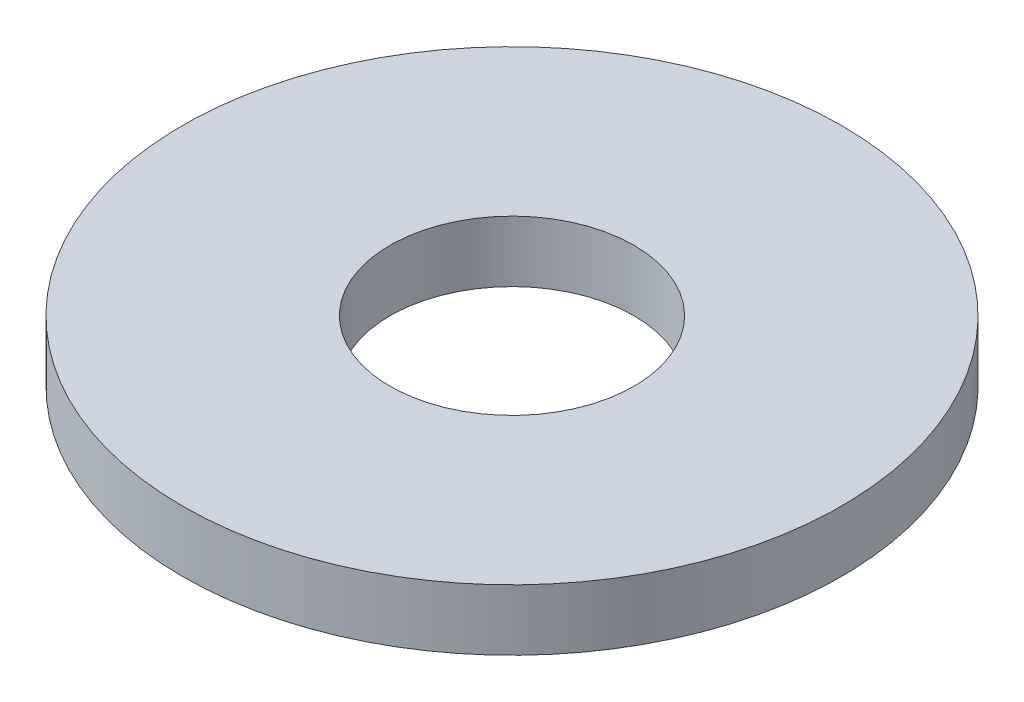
ISO-10303-21;
HEADER;
FILE_DESCRIPTION(('STEP AP214'),'2;1');
FILE_NAME('part.step','',(''),(''),'','','');
FILE_SCHEMA(('AUTOMOTIVE_DESIGN { 1 0 10303 214 1 1 1 1 }'));
ENDSEC;
DATA;
#1=APPLICATION_CONTEXT('core data for automotive mechanical design processes');
#2=APPLICATION_PROTOCOL_DEFINITION('international standard','automotive_design',2000,#1);
#3=PRODUCT_CONTEXT('',#1,'mechanical');
#4=PRODUCT('Part','Part','',(#3));
#5=PRODUCT_RELATED_PRODUCT_CATEGORY('part','',(#4));
#6=PRODUCT_DEFINITION_FORMATION('','',#4);
#7=PRODUCT_DEFINITION_CONTEXT('part definition',#1,'design');
#8=PRODUCT_DEFINITION('design','',#6,#7);
#9=PRODUCT_DEFINITION_SHAPE('','',#8);
#10=(LENGTH_UNIT() NAMED_UNIT(*) SI_UNIT(.MILLI.,.METRE.));
#11=(NAMED_UNIT(*) PLANE_ANGLE_UNIT() SI_UNIT($,.RADIAN.));
#12=(NAMED_UNIT(*) SI_UNIT($,.STERADIAN.) SOLID_ANGLE_UNIT());
#13=UNCERTAINTY_MEASURE_WITH_UNIT(LENGTH_MEASURE(1.E-05),#10,'distance_accuracy_value','');
#14=(GEOMETRIC_REPRESENTATION_CONTEXT(3) GLOBAL_UNCERTAINTY_ASSIGNED_CONTEXT((#13)) GLOBAL_UNIT_ASSIGNED_CONTEXT((#10,
#11,#12)) REPRESENTATION_CONTEXT('',''));
#15=CARTESIAN_POINT('',(0.,0.,0.));
#16=DIRECTION('',(0.,0.,1.));
#17=DIRECTION('',(1.,0.,0.));
#18=AXIS2_PLACEMENT_3D('',#15,#16,#17);
#19=CARTESIAN_POINT('',(8.1,1.5,0.));
#20=DIRECTION('',(0.,1.,0.));
#21=DIRECTION('',(0.,0.,1.));
#22=AXIS2_PLACEMENT_3D('',#19,#20,#21);
#23=PLANE('',#22);
#24=CARTESIAN_POINT('',(0.,1.5,0.));
#25=DIRECTION('',(0.,-1.,0.));
#26=DIRECTION('',(0.,0.,-1.));
#27=AXIS2_PLACEMENT_3D('',#24,#25,#26);
#28=CIRCLE('',#27,3.);
#29=CARTESIAN_POINT('',(0.,1.5,-3.));
#30=VERTEX_POINT('',#29);
#31=EDGE_CURVE('E10',#30,#30,#28,.T.);
#32=ORIENTED_EDGE('',*,*,#31,.T.);
#33=EDGE_LOOP('',(#32));
#34=FACE_BOUND('',#33,.T.);
#35=CARTESIAN_POINT('',(0.,1.5,0.));
#36=DIRECTION('',(0.,-1.,0.));
#37=DIRECTION('',(0.,0.,-1.));
#38=AXIS2_PLACEMENT_3D('',#35,#36,#37);
#39=CIRCLE('',#38,8.1);
#40=CARTESIAN_POINT('',(0.,1.5,-8.1));
#41=VERTEX_POINT('',#40);
#42=EDGE_CURVE('E47',#41,#41,#39,.T.);
#43=ORIENTED_EDGE('',*,*,#42,.F.);
#44=EDGE_LOOP('',(#43));
#45=FACE_BOUND('',#44,.T.);
#46=ADVANCED_FACE('F33',(#34,#45),#23,.T.);
#47=CARTESIAN_POINT('',(0.,1.5,0.));
#48=DIRECTION('',(0.,-1.,0.));
#49=DIRECTION('',(0.,0.,-1.));
#50=AXIS2_PLACEMENT_3D('',#47,#48,#49);
#51=CYLINDRICAL_SURFACE('',#50,3.);
#52=CARTESIAN_POINT('',(0.,0.,0.));
#53=DIRECTION('',(0.,-1.,0.));
#54=DIRECTION('',(0.,0.,-1.));
#55=AXIS2_PLACEMENT_3D('',#52,#53,#54);
#56=CIRCLE('',#55,3.);
#57=CARTESIAN_POINT('',(0.,0.,-3.));
#58=VERTEX_POINT('',#57);
#59=EDGE_CURVE('E39',#58,#58,#56,.T.);
#60=ORIENTED_EDGE('',*,*,#59,.T.);
#61=EDGE_LOOP('',(#60));
#62=FACE_BOUND('',#61,.T.);
#63=ORIENTED_EDGE('',*,*,#31,.F.);
#64=EDGE_LOOP('',(#63));
#65=FACE_BOUND('',#64,.T.);
#66=ADVANCED_FACE('F57',(#62,#65),#51,.F.);
#67=CARTESIAN_POINT('',(3.,0.,0.));
#68=DIRECTION('',(0.,-1.,0.));
#69=DIRECTION('',(0.,0.,-1.));
#70=AXIS2_PLACEMENT_3D('',#67,#68,#69);
#71=PLANE('',#70);
#72=CARTESIAN_POINT('',(0.,0.,0.));
#73=DIRECTION('',(0.,-1.,0.));
#74=DIRECTION('',(0.,0.,-1.));
#75=AXIS2_PLACEMENT_3D('',#72,#73,#74);
#76=CIRCLE('',#75,8.1);
#77=CARTESIAN_POINT('',(0.,0.,-8.1));
#78=VERTEX_POINT('',#77);
#79=EDGE_CURVE('E43',#78,#78,#76,.T.);
#80=ORIENTED_EDGE('',*,*,#79,.T.);
#81=EDGE_LOOP('',(#80));
#82=FACE_BOUND('',#81,.T.);
#83=ORIENTED_EDGE('',*,*,#59,.F.);
#84=EDGE_LOOP('',(#83));
#85=FACE_BOUND('',#84,.T.);
#86=ADVANCED_FACE('F61',(#82,#85),#71,.T.);
#87=CARTESIAN_POINT('',(0.,1.5,0.));
#88=DIRECTION('',(0.,-1.,0.));
#89=DIRECTION('',(0.,0.,-1.));
#90=AXIS2_PLACEMENT_3D('',#87,#88,#89);
#91=CYLINDRICAL_SURFACE('',#90,8.1);
#92=ORIENTED_EDGE('',*,*,#42,.T.);
#93=EDGE_LOOP('',(#92));
#94=FACE_BOUND('',#93,.T.);
#95=ORIENTED_EDGE('',*,*,#79,.F.);
#96=EDGE_LOOP('',(#95));
#97=FACE_BOUND('',#96,.T.);
#98=ADVANCED_FACE('F53',(#94,#97),#91,.T.);
#99=CLOSED_SHELL('',(#46,#66,#86,#98));
#100=MANIFOLD_SOLID_BREP('B2',#99);
#101=ADVANCED_BREP_SHAPE_REPRESENTATION('',(#18,#100),#14);
#102=SHAPE_DEFINITION_REPRESENTATION(#9,#101);
ENDSEC;
END-ISO-10303-21;
